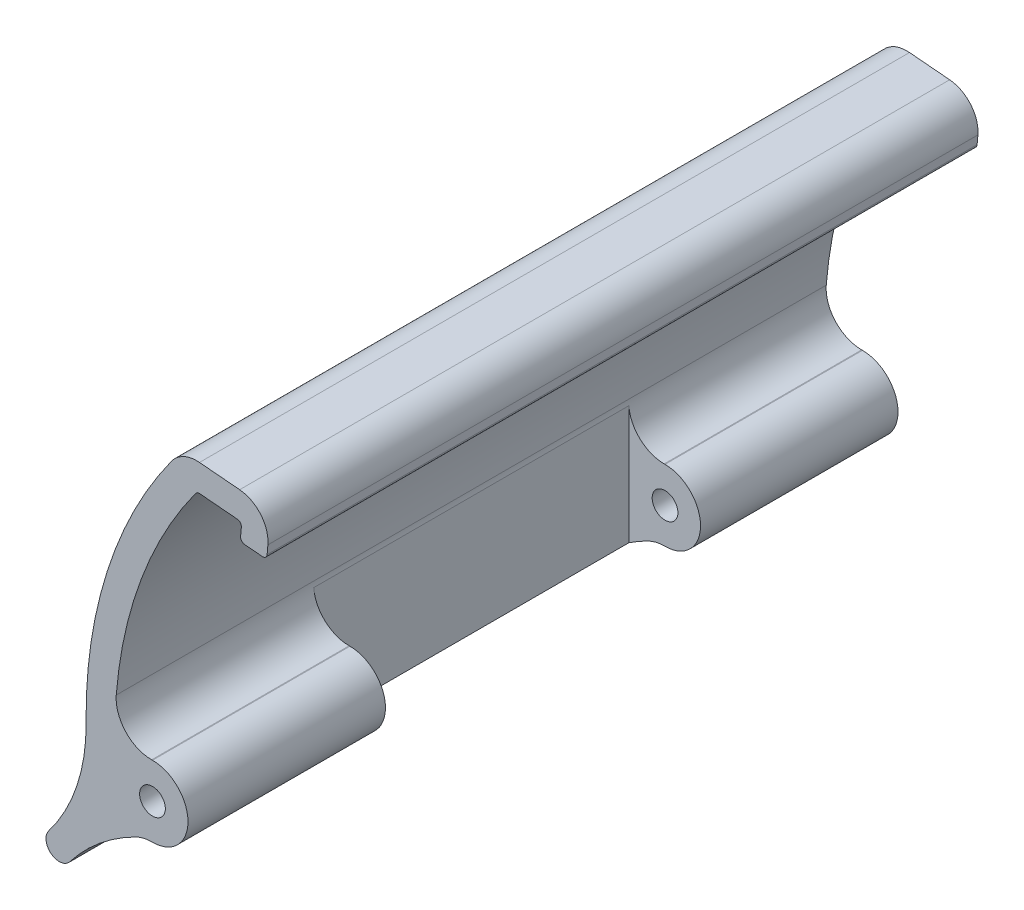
ISO-10303-21;
HEADER;
FILE_DESCRIPTION(('STEP AP214'),'2;1');
FILE_NAME('part.step','',(''),(''),'','','');
FILE_SCHEMA(('AUTOMOTIVE_DESIGN { 1 0 10303 214 1 1 1 1 }'));
ENDSEC;
DATA;
#1=APPLICATION_CONTEXT('core data for automotive mechanical design processes');
#2=APPLICATION_PROTOCOL_DEFINITION('international standard','automotive_design',2000,#1);
#3=PRODUCT_CONTEXT('',#1,'mechanical');
#4=PRODUCT('Part','Part','',(#3));
#5=PRODUCT_RELATED_PRODUCT_CATEGORY('part','',(#4));
#6=PRODUCT_DEFINITION_FORMATION('','',#4);
#7=PRODUCT_DEFINITION_CONTEXT('part definition',#1,'design');
#8=PRODUCT_DEFINITION('design','',#6,#7);
#9=PRODUCT_DEFINITION_SHAPE('','',#8);
#10=(LENGTH_UNIT() NAMED_UNIT(*) SI_UNIT(.MILLI.,.METRE.));
#11=(NAMED_UNIT(*) PLANE_ANGLE_UNIT() SI_UNIT($,.RADIAN.));
#12=(NAMED_UNIT(*) SI_UNIT($,.STERADIAN.) SOLID_ANGLE_UNIT());
#13=UNCERTAINTY_MEASURE_WITH_UNIT(LENGTH_MEASURE(1.E-05),#10,'distance_accuracy_value','');
#14=(GEOMETRIC_REPRESENTATION_CONTEXT(3) GLOBAL_UNCERTAINTY_ASSIGNED_CONTEXT((#13)) GLOBAL_UNIT_ASSIGNED_CONTEXT((#10,
#11,#12)) REPRESENTATION_CONTEXT('',''));
#15=CARTESIAN_POINT('',(0.,0.,0.));
#16=DIRECTION('',(0.,0.,1.));
#17=DIRECTION('',(1.,0.,0.));
#18=AXIS2_PLACEMENT_3D('',#15,#16,#17);
#19=CARTESIAN_POINT('',(-10.2594872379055,-3.29999999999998,40.));
#20=DIRECTION('',(0.,0.,-1.));
#21=DIRECTION('',(-1.,0.,0.));
#22=AXIS2_PLACEMENT_3D('',#19,#20,#21);
#23=CYLINDRICAL_SURFACE('',#22,4.);
#24=DIRECTION('',(0.,0.,1.));
#25=VECTOR('',#24,1.);
#26=CARTESIAN_POINT('',(-10.2594872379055,0.700000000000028,-46.7310757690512));
#27=LINE('',#26,#25);
#28=CARTESIAN_POINT('',(-10.2594872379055,0.700000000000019,-40.));
#29=VERTEX_POINT('',#28);
#30=CARTESIAN_POINT('',(-10.2594872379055,0.700000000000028,-17.75));
#31=VERTEX_POINT('',#30);
#32=EDGE_CURVE('E305',#29,#31,#27,.T.);
#33=ORIENTED_EDGE('',*,*,#32,.T.);
#34=CARTESIAN_POINT('',(-10.2594872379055,-3.29999999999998,-17.75));
#35=DIRECTION('',(0.,0.,1.));
#36=DIRECTION('',(1.,0.,0.));
#37=AXIS2_PLACEMENT_3D('',#34,#35,#36);
#38=CIRCLE('',#37,4.);
#39=CARTESIAN_POINT('',(-10.2594872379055,-7.29999999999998,-17.75));
#40=VERTEX_POINT('',#39);
#41=EDGE_CURVE('E295',#40,#31,#38,.T.);
#42=ORIENTED_EDGE('',*,*,#41,.F.);
#43=DIRECTION('',(0.,0.,1.));
#44=VECTOR('',#43,1.);
#45=CARTESIAN_POINT('',(-10.2594872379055,-7.29999999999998,-40.05));
#46=LINE('',#45,#44);
#47=CARTESIAN_POINT('',(-10.2594872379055,-7.29999999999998,-40.));
#48=VERTEX_POINT('',#47);
#49=EDGE_CURVE('E276',#48,#40,#46,.T.);
#50=ORIENTED_EDGE('',*,*,#49,.F.);
#51=CARTESIAN_POINT('',(-10.2594872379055,-3.29999999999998,-40.));
#52=DIRECTION('',(0.,0.,1.));
#53=DIRECTION('',(1.,0.,0.));
#54=AXIS2_PLACEMENT_3D('',#51,#52,#53);
#55=CIRCLE('',#54,4.);
#56=EDGE_CURVE('E331',#48,#29,#55,.T.);
#57=ORIENTED_EDGE('',*,*,#56,.T.);
#58=EDGE_LOOP('',(#33,#42,#50,#57));
#59=FACE_BOUND('',#58,.T.);
#60=ADVANCED_FACE('F45',(#59),#23,.T.);
#61=CARTESIAN_POINT('',(-10.2594872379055,-3.29999999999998,40.));
#62=DIRECTION('',(0.,0.,-1.));
#63=DIRECTION('',(-1.,0.,0.));
#64=AXIS2_PLACEMENT_3D('',#61,#62,#63);
#65=CYLINDRICAL_SURFACE('',#64,1.45);
#66=CARTESIAN_POINT('',(-10.2594872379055,-3.29999999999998,-40.));
#67=DIRECTION('',(0.,0.,1.));
#68=DIRECTION('',(1.,0.,0.));
#69=AXIS2_PLACEMENT_3D('',#66,#67,#68);
#70=CIRCLE('',#69,1.45);
#71=CARTESIAN_POINT('',(-8.8094872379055,-3.29999999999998,-40.));
#72=VERTEX_POINT('',#71);
#73=EDGE_CURVE('E332',#72,#72,#70,.T.);
#74=ORIENTED_EDGE('',*,*,#73,.F.);
#75=EDGE_LOOP('',(#74));
#76=FACE_BOUND('',#75,.T.);
#77=CARTESIAN_POINT('',(-10.2594872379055,-3.29999999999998,-17.75));
#78=DIRECTION('',(0.,0.,1.));
#79=DIRECTION('',(1.,0.,0.));
#80=AXIS2_PLACEMENT_3D('',#77,#78,#79);
#81=CIRCLE('',#80,1.45);
#82=CARTESIAN_POINT('',(-8.8094872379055,-3.29999999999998,-17.75));
#83=VERTEX_POINT('',#82);
#84=EDGE_CURVE('E297',#83,#83,#81,.T.);
#85=ORIENTED_EDGE('',*,*,#84,.T.);
#86=EDGE_LOOP('',(#85));
#87=FACE_BOUND('',#86,.T.);
#88=ADVANCED_FACE('F504',(#76,#87),#65,.F.);
#89=CARTESIAN_POINT('',(-14.4918878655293,0.700000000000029,-46.7310757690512));
#90=DIRECTION('',(0.,-1.,0.));
#91=DIRECTION('',(1.,0.,0.));
#92=AXIS2_PLACEMENT_3D('',#89,#90,#91);
#93=PLANE('',#92);
#94=DIRECTION('',(-1.,0.,0.));
#95=VECTOR('',#94,1.);
#96=CARTESIAN_POINT('',(-14.4918878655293,0.700000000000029,-17.75));
#97=LINE('',#96,#95);
#98=CARTESIAN_POINT('',(-10.3550938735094,0.700000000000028,-17.75));
#99=VERTEX_POINT('',#98);
#100=EDGE_CURVE('E293',#31,#99,#97,.T.);
#101=ORIENTED_EDGE('',*,*,#100,.F.);
#102=ORIENTED_EDGE('',*,*,#32,.F.);
#103=DIRECTION('',(-1.,0.,0.));
#104=VECTOR('',#103,1.);
#105=CARTESIAN_POINT('',(-14.4918878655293,0.700000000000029,-40.));
#106=LINE('',#105,#104);
#107=CARTESIAN_POINT('',(-10.3550938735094,0.700000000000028,-40.));
#108=VERTEX_POINT('',#107);
#109=EDGE_CURVE('E301',#29,#108,#106,.T.);
#110=ORIENTED_EDGE('',*,*,#109,.T.);
#111=DIRECTION('',(0.,0.,-1.));
#112=VECTOR('',#111,1.);
#113=CARTESIAN_POINT('',(-10.3550938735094,0.700000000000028,40.));
#114=LINE('',#113,#112);
#115=EDGE_CURVE('E413',#108,#99,#114,.F.);
#116=ORIENTED_EDGE('',*,*,#115,.T.);
#117=EDGE_LOOP('',(#101,#102,#110,#116));
#118=FACE_BOUND('',#117,.T.);
#119=ADVANCED_FACE('F509',(#118),#93,.F.);
#120=CARTESIAN_POINT('',(-10.3550938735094,4.70000000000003,-79.5));
#121=DIRECTION('',(0.,0.,1.));
#122=DIRECTION('',(1.,0.,0.));
#123=AXIS2_PLACEMENT_3D('',#120,#121,#122);
#124=CYLINDRICAL_SURFACE('',#123,4.);
#125=CARTESIAN_POINT('',(-10.3550938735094,4.70000000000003,-17.75));
#126=DIRECTION('',(0.,0.,1.));
#127=DIRECTION('',(1.,0.,0.));
#128=AXIS2_PLACEMENT_3D('',#125,#126,#127);
#129=CIRCLE('',#128,4.);
#130=CARTESIAN_POINT('',(-14.3422557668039,4.37978126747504,-17.75));
#131=VERTEX_POINT('',#130);
#132=EDGE_CURVE('E430',#99,#131,#129,.F.);
#133=ORIENTED_EDGE('',*,*,#132,.F.);
#134=ORIENTED_EDGE('',*,*,#115,.F.);
#135=CARTESIAN_POINT('',(-10.3550938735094,4.70000000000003,-40.));
#136=DIRECTION('',(0.,0.,1.));
#137=DIRECTION('',(1.,0.,0.));
#138=AXIS2_PLACEMENT_3D('',#135,#136,#137);
#139=CIRCLE('',#138,4.);
#140=CARTESIAN_POINT('',(-14.3422557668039,5.02021873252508,-40.));
#141=VERTEX_POINT('',#140);
#142=EDGE_CURVE('E421',#141,#108,#139,.T.);
#143=ORIENTED_EDGE('',*,*,#142,.F.);
#144=DIRECTION('',(0.,0.,1.));
#145=VECTOR('',#144,1.);
#146=CARTESIAN_POINT('',(-14.3422557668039,5.02021873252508,-79.5));
#147=LINE('',#146,#145);
#148=CARTESIAN_POINT('',(-14.3422557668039,5.02021873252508,40.));
#149=VERTEX_POINT('',#148);
#150=EDGE_CURVE('E420',#149,#141,#147,.F.);
#151=ORIENTED_EDGE('',*,*,#150,.F.);
#152=CARTESIAN_POINT('',(-10.3550938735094,4.70000000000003,40.));
#153=DIRECTION('',(0.,0.,1.));
#154=DIRECTION('',(1.,0.,0.));
#155=AXIS2_PLACEMENT_3D('',#152,#153,#154);
#156=CIRCLE('',#155,4.);
#157=CARTESIAN_POINT('',(-10.3550938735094,0.700000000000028,40.));
#158=VERTEX_POINT('',#157);
#159=EDGE_CURVE('E405',#158,#149,#156,.F.);
#160=ORIENTED_EDGE('',*,*,#159,.F.);
#161=CARTESIAN_POINT('',(-10.3550938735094,0.700000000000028,17.75));
#162=VERTEX_POINT('',#161);
#163=EDGE_CURVE('E410',#162,#158,#114,.F.);
#164=ORIENTED_EDGE('',*,*,#163,.F.);
#165=CARTESIAN_POINT('',(-10.3550938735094,4.70000000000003,17.75));
#166=DIRECTION('',(0.,0.,1.));
#167=DIRECTION('',(1.,0.,0.));
#168=AXIS2_PLACEMENT_3D('',#165,#166,#167);
#169=CIRCLE('',#168,4.);
#170=CARTESIAN_POINT('',(-14.3422557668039,4.37978126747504,17.75));
#171=VERTEX_POINT('',#170);
#172=EDGE_CURVE('E423',#162,#171,#169,.F.);
#173=ORIENTED_EDGE('',*,*,#172,.T.);
#174=DIRECTION('',(0.,0.,1.));
#175=VECTOR('',#174,1.);
#176=CARTESIAN_POINT('',(-14.3422557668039,4.37978126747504,-79.5));
#177=LINE('',#176,#175);
#178=EDGE_CURVE('E428',#171,#131,#177,.F.);
#179=ORIENTED_EDGE('',*,*,#178,.T.);
#180=EDGE_LOOP('',(#133,#134,#143,#151,#160,#164,#173,#179));
#181=FACE_BOUND('',#180,.T.);
#182=ADVANCED_FACE('F417',(#181),#124,.F.);
#183=CARTESIAN_POINT('',(33.0052917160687,1.21762128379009,-79.5));
#184=DIRECTION('',(0.,0.,1.));
#185=DIRECTION('',(1.,0.,0.));
#186=AXIS2_PLACEMENT_3D('',#183,#184,#185);
#187=CYLINDRICAL_SURFACE('',#186,47.5);
#188=CARTESIAN_POINT('',(33.0052917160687,1.21762128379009,-40.));
#189=DIRECTION('',(0.,0.,1.));
#190=DIRECTION('',(1.,0.,0.));
#191=AXIS2_PLACEMENT_3D('',#188,#189,#190);
#192=CIRCLE('',#191,47.5);
#193=CARTESIAN_POINT('',(-5.39567474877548,29.1750134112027,-40.));
#194=VERTEX_POINT('',#193);
#195=EDGE_CURVE('E342',#194,#141,#192,.T.);
#196=ORIENTED_EDGE('',*,*,#195,.F.);
#197=DIRECTION('',(0.,0.,1.));
#198=VECTOR('',#197,1.);
#199=CARTESIAN_POINT('',(-5.39567474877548,29.1750134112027,-79.5));
#200=LINE('',#199,#198);
#201=CARTESIAN_POINT('',(-5.39567474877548,29.1750134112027,40.));
#202=VERTEX_POINT('',#201);
#203=EDGE_CURVE('E432',#194,#202,#200,.T.);
#204=ORIENTED_EDGE('',*,*,#203,.T.);
#205=CARTESIAN_POINT('',(33.0052917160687,1.21762128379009,40.));
#206=DIRECTION('',(0.,0.,1.));
#207=DIRECTION('',(1.,0.,0.));
#208=AXIS2_PLACEMENT_3D('',#205,#206,#207);
#209=CIRCLE('',#208,47.5);
#210=EDGE_CURVE('E338',#202,#149,#209,.T.);
#211=ORIENTED_EDGE('',*,*,#210,.T.);
#212=ORIENTED_EDGE('',*,*,#150,.T.);
#213=EDGE_LOOP('',(#196,#204,#211,#212));
#214=FACE_BOUND('',#213,.T.);
#215=ADVANCED_FACE('F499',(#214),#187,.F.);
#216=CARTESIAN_POINT('',(-10.2594872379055,0.700000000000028,17.75));
#217=VERTEX_POINT('',#216);
#218=CARTESIAN_POINT('',(-10.2594872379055,0.700000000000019,40.));
#219=VERTEX_POINT('',#218);
#220=EDGE_CURVE('E308',#217,#219,#27,.T.);
#221=ORIENTED_EDGE('',*,*,#220,.T.);
#222=CARTESIAN_POINT('',(-10.2594872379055,-3.29999999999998,40.));
#223=DIRECTION('',(0.,0.,1.));
#224=DIRECTION('',(1.,0.,0.));
#225=AXIS2_PLACEMENT_3D('',#222,#223,#224);
#226=CIRCLE('',#225,4.);
#227=CARTESIAN_POINT('',(-10.2594872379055,-7.29999999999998,40.));
#228=VERTEX_POINT('',#227);
#229=EDGE_CURVE('E336',#228,#219,#226,.T.);
#230=ORIENTED_EDGE('',*,*,#229,.F.);
#231=CARTESIAN_POINT('',(-10.2594872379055,-7.29999999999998,17.75));
#232=VERTEX_POINT('',#231);
#233=EDGE_CURVE('E273',#232,#228,#46,.T.);
#234=ORIENTED_EDGE('',*,*,#233,.F.);
#235=CARTESIAN_POINT('',(-10.2594872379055,-3.29999999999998,17.75));
#236=DIRECTION('',(0.,0.,1.));
#237=DIRECTION('',(1.,0.,0.));
#238=AXIS2_PLACEMENT_3D('',#235,#236,#237);
#239=CIRCLE('',#238,4.);
#240=EDGE_CURVE('E288',#232,#217,#239,.T.);
#241=ORIENTED_EDGE('',*,*,#240,.T.);
#242=EDGE_LOOP('',(#221,#230,#234,#241));
#243=FACE_BOUND('',#242,.T.);
#244=ADVANCED_FACE('F398',(#243),#23,.T.);
#245=CARTESIAN_POINT('',(33.0052917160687,1.21762128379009,40.));
#246=DIRECTION('',(0.,0.,-1.));
#247=DIRECTION('',(-1.,0.,0.));
#248=AXIS2_PLACEMENT_3D('',#245,#246,#247);
#249=CYLINDRICAL_SURFACE('',#248,50.75);
#250=CARTESIAN_POINT('',(33.0052917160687,1.21762128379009,-40.));
#251=DIRECTION('',(0.,0.,1.));
#252=DIRECTION('',(1.,0.,0.));
#253=AXIS2_PLACEMENT_3D('',#250,#251,#252);
#254=CIRCLE('',#253,50.75);
#255=CARTESIAN_POINT('',(-8.10506982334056,30.9749846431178,-40.));
#256=VERTEX_POINT('',#255);
#257=CARTESIAN_POINT('',(-17.7409726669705,0.601868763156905,-40.));
#258=VERTEX_POINT('',#257);
#259=EDGE_CURVE('E341',#256,#258,#254,.T.);
#260=ORIENTED_EDGE('',*,*,#259,.T.);
#261=DIRECTION('',(0.,0.,1.));
#262=VECTOR('',#261,1.);
#263=CARTESIAN_POINT('',(-17.7409726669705,0.601868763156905,-58.1332455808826));
#264=LINE('',#263,#262);
#265=CARTESIAN_POINT('',(-17.7409726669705,0.601868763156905,40.));
#266=VERTEX_POINT('',#265);
#267=EDGE_CURVE('E241',#258,#266,#264,.T.);
#268=ORIENTED_EDGE('',*,*,#267,.T.);
#269=CARTESIAN_POINT('',(33.0052917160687,1.21762128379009,40.));
#270=DIRECTION('',(0.,0.,1.));
#271=DIRECTION('',(1.,0.,0.));
#272=AXIS2_PLACEMENT_3D('',#269,#270,#271);
#273=CIRCLE('',#272,50.75);
#274=CARTESIAN_POINT('',(-8.10506982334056,30.9749846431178,40.));
#275=VERTEX_POINT('',#274);
#276=EDGE_CURVE('E255',#275,#266,#273,.T.);
#277=ORIENTED_EDGE('',*,*,#276,.F.);
#278=DIRECTION('',(0.,0.,-1.));
#279=VECTOR('',#278,1.);
#280=CARTESIAN_POINT('',(-8.10506982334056,30.9749846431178,40.));
#281=LINE('',#280,#279);
#282=EDGE_CURVE('E450',#275,#256,#281,.T.);
#283=ORIENTED_EDGE('',*,*,#282,.T.);
#284=EDGE_LOOP('',(#260,#268,#277,#283));
#285=FACE_BOUND('',#284,.T.);
#286=ADVANCED_FACE('F491',(#285),#249,.T.);
#287=CARTESIAN_POINT('',(33.0052917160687,1.21762128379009,40.));
#288=DIRECTION('',(0.,0.,1.));
#289=DIRECTION('',(1.,0.,0.));
#290=AXIS2_PLACEMENT_3D('',#287,#288,#289);
#291=PLANE('',#290);
#292=ORIENTED_EDGE('',*,*,#276,.T.);
#293=CARTESIAN_POINT('',(-38.045917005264,0.3554896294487,40.));
#294=DIRECTION('',(0.,0.,1.));
#295=DIRECTION('',(1.,0.,0.));
#296=AXIS2_PLACEMENT_3D('',#293,#294,#295);
#297=CIRCLE('',#296,20.3064390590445);
#298=CARTESIAN_POINT('',(-21.9485692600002,-12.0229942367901,40.));
#299=VERTEX_POINT('',#298);
#300=EDGE_CURVE('E235',#266,#299,#297,.F.);
#301=ORIENTED_EDGE('',*,*,#300,.T.);
#302=CARTESIAN_POINT('',(-20.7594872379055,-12.937370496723,40.));
#303=DIRECTION('',(0.,0.,1.));
#304=DIRECTION('',(1.,0.,0.));
#305=AXIS2_PLACEMENT_3D('',#302,#303,#304);
#306=CIRCLE('',#305,1.50000000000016);
#307=CARTESIAN_POINT('',(-19.5704052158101,-13.8517467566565,40.));
#308=VERTEX_POINT('',#307);
#309=EDGE_CURVE('E245',#299,#308,#306,.T.);
#310=ORIENTED_EDGE('',*,*,#309,.T.);
#311=CARTESIAN_POINT('',(-2.52762855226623,-26.9572433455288,40.));
#312=DIRECTION('',(0.,0.,1.));
#313=DIRECTION('',(1.,0.,0.));
#314=AXIS2_PLACEMENT_3D('',#311,#312,#313);
#315=CIRCLE('',#314,21.4990761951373);
#316=CARTESIAN_POINT('',(-12.1285505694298,-7.72101259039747,40.));
#317=VERTEX_POINT('',#316);
#318=EDGE_CURVE('E268',#317,#308,#315,.T.);
#319=ORIENTED_EDGE('',*,*,#318,.F.);
#320=CARTESIAN_POINT('',(-10.3422557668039,-11.3,40.));
#321=DIRECTION('',(0.,0.,1.));
#322=DIRECTION('',(1.,0.,0.));
#323=AXIS2_PLACEMENT_3D('',#320,#321,#322);
#324=CIRCLE('',#323,4.);
#325=CARTESIAN_POINT('',(-10.3422557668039,-7.29999999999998,40.));
#326=VERTEX_POINT('',#325);
#327=EDGE_CURVE('E371',#317,#326,#324,.F.);
#328=ORIENTED_EDGE('',*,*,#327,.T.);
#329=DIRECTION('',(-1.,0.,0.));
#330=VECTOR('',#329,1.);
#331=CARTESIAN_POINT('',(-10.2594872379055,-7.29999999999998,40.));
#332=LINE('',#331,#330);
#333=EDGE_CURVE('E270',#228,#326,#332,.T.);
#334=ORIENTED_EDGE('',*,*,#333,.F.);
#335=ORIENTED_EDGE('',*,*,#229,.T.);
#336=DIRECTION('',(1.,0.,0.));
#337=VECTOR('',#336,1.);
#338=CARTESIAN_POINT('',(-14.4918878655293,0.700000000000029,40.));
#339=LINE('',#338,#337);
#340=EDGE_CURVE('E300',#158,#219,#339,.T.);
#341=ORIENTED_EDGE('',*,*,#340,.F.);
#342=ORIENTED_EDGE('',*,*,#159,.T.);
#343=ORIENTED_EDGE('',*,*,#210,.F.);
#344=CARTESIAN_POINT('',(-4.99145404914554,28.8807250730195,40.));
#345=DIRECTION('',(0.,0.,1.));
#346=DIRECTION('',(1.,0.,0.));
#347=AXIS2_PLACEMENT_3D('',#344,#345,#346);
#348=CIRCLE('',#347,0.5);
#349=CARTESIAN_POINT('',(-4.94787617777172,29.3788224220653,40.));
#350=VERTEX_POINT('',#349);
#351=EDGE_CURVE('E442',#202,#350,#348,.F.);
#352=ORIENTED_EDGE('',*,*,#351,.T.);
#353=DIRECTION('',(-0.996194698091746,0.0871557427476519,0.));
#354=VECTOR('',#353,1.);
#355=CARTESIAN_POINT('',(-4.83647437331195,29.3690760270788,40.));
#356=LINE('',#355,#354);
#357=CARTESIAN_POINT('',(-0.700918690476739,29.0072617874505,40.));
#358=VERTEX_POINT('',#357);
#359=EDGE_CURVE('E335',#358,#350,#356,.T.);
#360=ORIENTED_EDGE('',*,*,#359,.F.);
#361=CARTESIAN_POINT('',(-0.744496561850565,28.5091644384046,40.));
#362=DIRECTION('',(0.,0.,1.));
#363=DIRECTION('',(1.,0.,0.));
#364=AXIS2_PLACEMENT_3D('',#361,#362,#363);
#365=CIRCLE('',#364,0.5);
#366=CARTESIAN_POINT('',(-0.246399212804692,28.4655865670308,40.));
#367=VERTEX_POINT('',#366);
#368=EDGE_CURVE('E448',#358,#367,#365,.F.);
#369=ORIENTED_EDGE('',*,*,#368,.T.);
#370=DIRECTION('',(0.087155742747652,0.996194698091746,0.));
#371=VECTOR('',#370,1.);
#372=CARTESIAN_POINT('',(-0.375598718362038,26.9888294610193,40.));
#373=LINE('',#372,#371);
#374=CARTESIAN_POINT('',(-0.332020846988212,27.4869268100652,40.));
#375=VERTEX_POINT('',#374);
#376=EDGE_CURVE('E304',#375,#367,#373,.T.);
#377=ORIENTED_EDGE('',*,*,#376,.F.);
#378=CARTESIAN_POINT('',(0.166076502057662,27.4433489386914,40.));
#379=DIRECTION('',(0.,0.,1.));
#380=DIRECTION('',(1.,0.,0.));
#381=AXIS2_PLACEMENT_3D('',#378,#379,#380);
#382=CIRCLE('',#381,0.5);
#383=CARTESIAN_POINT('',(0.122498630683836,26.9452515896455,40.));
#384=VERTEX_POINT('',#383);
#385=EDGE_CURVE('E804',#375,#384,#382,.T.);
#386=ORIENTED_EDGE('',*,*,#385,.T.);
#387=DIRECTION('',(0.996194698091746,-0.087155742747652,0.));
#388=VECTOR('',#387,1.);
#389=CARTESIAN_POINT('',(-0.375598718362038,26.9888294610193,40.));
#390=LINE('',#389,#388);
#391=CARTESIAN_POINT('',(2.11488802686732,26.7709401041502,40.));
#392=VERTEX_POINT('',#391);
#393=EDGE_CURVE('E317',#384,#392,#390,.T.);
#394=ORIENTED_EDGE('',*,*,#393,.T.);
#395=CARTESIAN_POINT('',(2.15846589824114,27.2690374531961,40.));
#396=DIRECTION('',(0.,0.,1.));
#397=DIRECTION('',(1.,0.,0.));
#398=AXIS2_PLACEMENT_3D('',#395,#396,#397);
#399=CIRCLE('',#398,0.5);
#400=CARTESIAN_POINT('',(2.65656324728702,27.2254595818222,40.));
#401=VERTEX_POINT('',#400);
#402=EDGE_CURVE('E475',#392,#401,#399,.T.);
#403=ORIENTED_EDGE('',*,*,#402,.T.);
#404=DIRECTION('',(0.0871557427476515,0.996194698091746,0.));
#405=VECTOR('',#404,1.);
#406=CARTESIAN_POINT('',(2.8409614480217,29.333140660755,40.));
#407=LINE('',#406,#405);
#408=CARTESIAN_POINT('',(2.74371899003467,28.221654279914,40.));
#409=VERTEX_POINT('',#408);
#410=EDGE_CURVE('E327',#401,#409,#407,.T.);
#411=ORIENTED_EDGE('',*,*,#410,.T.);
#412=CARTESIAN_POINT('',(-0.742962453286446,28.5266993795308,40.));
#413=DIRECTION('',(0.,0.,1.));
#414=DIRECTION('',(1.,0.,0.));
#415=AXIS2_PLACEMENT_3D('',#412,#413,#414);
#416=CIRCLE('',#415,3.5);
#417=CARTESIAN_POINT('',(-0.437917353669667,32.0133808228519,40.));
#418=VERTEX_POINT('',#417);
#419=EDGE_CURVE('E462',#409,#418,#416,.T.);
#420=ORIENTED_EDGE('',*,*,#419,.T.);
#421=DIRECTION('',(-0.996194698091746,0.087155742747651,0.));
#422=VECTOR('',#421,1.);
#423=CARTESIAN_POINT('',(-6.,32.5,40.));
#424=LINE('',#423,#422);
#425=CARTESIAN_POINT('',(-4.96482737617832,32.4094341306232,40.));
#426=VERTEX_POINT('',#425);
#427=EDGE_CURVE('E320',#418,#426,#424,.T.);
#428=ORIENTED_EDGE('',*,*,#427,.T.);
#429=CARTESIAN_POINT('',(-5.2698724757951,28.9227526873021,40.));
#430=DIRECTION('',(0.,0.,1.));
#431=DIRECTION('',(1.,0.,0.));
#432=AXIS2_PLACEMENT_3D('',#429,#430,#431);
#433=CIRCLE('',#432,3.5);
#434=EDGE_CURVE('E464',#426,#275,#433,.T.);
#435=ORIENTED_EDGE('',*,*,#434,.T.);
#436=EDGE_LOOP('',(#292,#301,#310,#319,#328,#334,#335,#341,#342,#343,#352,#360,#369,#377,#386,
#394,#403,#411,#420,#428,#435));
#437=FACE_BOUND('',#436,.T.);
#438=CARTESIAN_POINT('',(-10.2594872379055,-3.29999999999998,40.));
#439=DIRECTION('',(0.,0.,1.));
#440=DIRECTION('',(1.,0.,0.));
#441=AXIS2_PLACEMENT_3D('',#438,#439,#440);
#442=CIRCLE('',#441,1.45);
#443=CARTESIAN_POINT('',(-8.8094872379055,-3.29999999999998,40.));
#444=VERTEX_POINT('',#443);
#445=EDGE_CURVE('E328',#444,#444,#442,.T.);
#446=ORIENTED_EDGE('',*,*,#445,.F.);
#447=EDGE_LOOP('',(#446));
#448=FACE_BOUND('',#447,.T.);
#449=ADVANCED_FACE('F252',(#437,#448),#291,.T.);
#450=CARTESIAN_POINT('',(33.0052917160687,1.21762128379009,-40.));
#451=DIRECTION('',(0.,0.,1.));
#452=DIRECTION('',(1.,0.,0.));
#453=AXIS2_PLACEMENT_3D('',#450,#451,#452);
#454=PLANE('',#453);
#455=CARTESIAN_POINT('',(-2.52762855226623,-26.9572433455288,-40.));
#456=DIRECTION('',(0.,0.,1.));
#457=DIRECTION('',(1.,0.,0.));
#458=AXIS2_PLACEMENT_3D('',#455,#456,#457);
#459=CIRCLE('',#458,21.4990761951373);
#460=CARTESIAN_POINT('',(-12.1285505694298,-7.72101259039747,-40.));
#461=VERTEX_POINT('',#460);
#462=CARTESIAN_POINT('',(-19.5704052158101,-13.8517467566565,-40.));
#463=VERTEX_POINT('',#462);
#464=EDGE_CURVE('E266',#461,#463,#459,.T.);
#465=ORIENTED_EDGE('',*,*,#464,.T.);
#466=CARTESIAN_POINT('',(-20.7594872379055,-12.937370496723,-40.));
#467=DIRECTION('',(0.,0.,1.));
#468=DIRECTION('',(1.,0.,0.));
#469=AXIS2_PLACEMENT_3D('',#466,#467,#468);
#470=CIRCLE('',#469,1.50000000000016);
#471=CARTESIAN_POINT('',(-21.9485692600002,-12.0229942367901,-40.));
#472=VERTEX_POINT('',#471);
#473=EDGE_CURVE('E260',#463,#472,#470,.F.);
#474=ORIENTED_EDGE('',*,*,#473,.T.);
#475=CARTESIAN_POINT('',(-38.045917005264,0.3554896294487,-40.));
#476=DIRECTION('',(0.,0.,1.));
#477=DIRECTION('',(1.,0.,0.));
#478=AXIS2_PLACEMENT_3D('',#475,#476,#477);
#479=CIRCLE('',#478,20.3064390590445);
#480=EDGE_CURVE('E237',#472,#258,#479,.T.);
#481=ORIENTED_EDGE('',*,*,#480,.T.);
#482=ORIENTED_EDGE('',*,*,#259,.F.);
#483=CARTESIAN_POINT('',(-5.2698724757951,28.9227526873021,-40.));
#484=DIRECTION('',(0.,0.,1.));
#485=DIRECTION('',(1.,0.,0.));
#486=AXIS2_PLACEMENT_3D('',#483,#484,#485);
#487=CIRCLE('',#486,3.5);
#488=CARTESIAN_POINT('',(-4.96482737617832,32.4094341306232,-40.));
#489=VERTEX_POINT('',#488);
#490=EDGE_CURVE('E455',#256,#489,#487,.F.);
#491=ORIENTED_EDGE('',*,*,#490,.T.);
#492=DIRECTION('',(-0.996194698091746,0.087155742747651,0.));
#493=VECTOR('',#492,1.);
#494=CARTESIAN_POINT('',(-6.,32.5,-40.));
#495=LINE('',#494,#493);
#496=CARTESIAN_POINT('',(-0.437917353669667,32.0133808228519,-40.));
#497=VERTEX_POINT('',#496);
#498=EDGE_CURVE('E324',#497,#489,#495,.T.);
#499=ORIENTED_EDGE('',*,*,#498,.F.);
#500=CARTESIAN_POINT('',(-0.742962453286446,28.5266993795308,-40.));
#501=DIRECTION('',(0.,0.,1.));
#502=DIRECTION('',(1.,0.,0.));
#503=AXIS2_PLACEMENT_3D('',#500,#501,#502);
#504=CIRCLE('',#503,3.5);
#505=CARTESIAN_POINT('',(2.74371899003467,28.221654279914,-40.));
#506=VERTEX_POINT('',#505);
#507=EDGE_CURVE('E453',#497,#506,#504,.F.);
#508=ORIENTED_EDGE('',*,*,#507,.T.);
#509=DIRECTION('',(0.0871557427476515,0.996194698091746,0.));
#510=VECTOR('',#509,1.);
#511=CARTESIAN_POINT('',(2.8409614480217,29.333140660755,-40.));
#512=LINE('',#511,#510);
#513=CARTESIAN_POINT('',(2.65656324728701,27.2254595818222,-40.));
#514=VERTEX_POINT('',#513);
#515=EDGE_CURVE('E319',#514,#506,#512,.T.);
#516=ORIENTED_EDGE('',*,*,#515,.F.);
#517=CARTESIAN_POINT('',(2.15846589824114,27.2690374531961,-40.));
#518=DIRECTION('',(0.,0.,1.));
#519=DIRECTION('',(1.,0.,0.));
#520=AXIS2_PLACEMENT_3D('',#517,#518,#519);
#521=CIRCLE('',#520,0.5);
#522=CARTESIAN_POINT('',(2.11488802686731,26.7709401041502,-40.));
#523=VERTEX_POINT('',#522);
#524=EDGE_CURVE('E809',#514,#523,#521,.F.);
#525=ORIENTED_EDGE('',*,*,#524,.T.);
#526=DIRECTION('',(0.996194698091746,-0.087155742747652,0.));
#527=VECTOR('',#526,1.);
#528=CARTESIAN_POINT('',(-0.375598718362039,26.9888294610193,-40.));
#529=LINE('',#528,#527);
#530=CARTESIAN_POINT('',(0.122498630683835,26.9452515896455,-40.));
#531=VERTEX_POINT('',#530);
#532=EDGE_CURVE('E315',#531,#523,#529,.T.);
#533=ORIENTED_EDGE('',*,*,#532,.F.);
#534=CARTESIAN_POINT('',(0.166076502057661,27.4433489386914,-40.));
#535=DIRECTION('',(0.,0.,1.));
#536=DIRECTION('',(1.,0.,0.));
#537=AXIS2_PLACEMENT_3D('',#534,#535,#536);
#538=CIRCLE('',#537,0.5);
#539=CARTESIAN_POINT('',(-0.332020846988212,27.4869268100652,-40.));
#540=VERTEX_POINT('',#539);
#541=EDGE_CURVE('E414',#531,#540,#538,.F.);
#542=ORIENTED_EDGE('',*,*,#541,.T.);
#543=DIRECTION('',(-0.087155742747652,-0.996194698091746,0.));
#544=VECTOR('',#543,1.);
#545=CARTESIAN_POINT('',(0.0601799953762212,31.969802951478,-40.));
#546=LINE('',#545,#544);
#547=CARTESIAN_POINT('',(-0.246399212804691,28.4655865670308,-40.));
#548=VERTEX_POINT('',#547);
#549=EDGE_CURVE('E313',#548,#540,#546,.T.);
#550=ORIENTED_EDGE('',*,*,#549,.F.);
#551=CARTESIAN_POINT('',(-0.744496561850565,28.5091644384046,-40.));
#552=DIRECTION('',(0.,0.,1.));
#553=DIRECTION('',(1.,0.,0.));
#554=AXIS2_PLACEMENT_3D('',#551,#552,#553);
#555=CIRCLE('',#554,0.5);
#556=CARTESIAN_POINT('',(-0.700918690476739,29.0072617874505,-40.));
#557=VERTEX_POINT('',#556);
#558=EDGE_CURVE('E446',#548,#557,#555,.T.);
#559=ORIENTED_EDGE('',*,*,#558,.T.);
#560=DIRECTION('',(-0.996194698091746,0.0871557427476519,0.));
#561=VECTOR('',#560,1.);
#562=CARTESIAN_POINT('',(-4.83647437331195,29.3690760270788,-40.));
#563=LINE('',#562,#561);
#564=CARTESIAN_POINT('',(-4.94787617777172,29.3788224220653,-40.));
#565=VERTEX_POINT('',#564);
#566=EDGE_CURVE('E323',#557,#565,#563,.T.);
#567=ORIENTED_EDGE('',*,*,#566,.T.);
#568=CARTESIAN_POINT('',(-4.99145404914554,28.8807250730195,-40.));
#569=DIRECTION('',(0.,0.,1.));
#570=DIRECTION('',(1.,0.,0.));
#571=AXIS2_PLACEMENT_3D('',#568,#569,#570);
#572=CIRCLE('',#571,0.5);
#573=EDGE_CURVE('E444',#565,#194,#572,.T.);
#574=ORIENTED_EDGE('',*,*,#573,.T.);
#575=ORIENTED_EDGE('',*,*,#195,.T.);
#576=ORIENTED_EDGE('',*,*,#142,.T.);
#577=ORIENTED_EDGE('',*,*,#109,.F.);
#578=ORIENTED_EDGE('',*,*,#56,.F.);
#579=DIRECTION('',(-1.,0.,0.));
#580=VECTOR('',#579,1.);
#581=CARTESIAN_POINT('',(33.0052917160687,-7.29999999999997,-40.));
#582=LINE('',#581,#580);
#583=CARTESIAN_POINT('',(-10.3422557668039,-7.29999999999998,-40.));
#584=VERTEX_POINT('',#583);
#585=EDGE_CURVE('E280',#48,#584,#582,.T.);
#586=ORIENTED_EDGE('',*,*,#585,.T.);
#587=CARTESIAN_POINT('',(-10.3422557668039,-11.3,-40.));
#588=DIRECTION('',(0.,0.,1.));
#589=DIRECTION('',(1.,0.,0.));
#590=AXIS2_PLACEMENT_3D('',#587,#588,#589);
#591=CIRCLE('',#590,4.);
#592=EDGE_CURVE('E368',#584,#461,#591,.T.);
#593=ORIENTED_EDGE('',*,*,#592,.T.);
#594=EDGE_LOOP('',(#465,#474,#481,#482,#491,#499,#508,#516,#525,#533,#542,#550,#559,#567,#574,
#575,#576,#577,#578,#586,#593));
#595=FACE_BOUND('',#594,.T.);
#596=ORIENTED_EDGE('',*,*,#73,.T.);
#597=EDGE_LOOP('',(#596));
#598=FACE_BOUND('',#597,.T.);
#599=ADVANCED_FACE('F483',(#595,#598),#454,.F.);
#600=CARTESIAN_POINT('',(-10.2594872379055,-3.29999999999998,17.75));
#601=DIRECTION('',(0.,0.,1.));
#602=DIRECTION('',(1.,0.,0.));
#603=AXIS2_PLACEMENT_3D('',#600,#601,#602);
#604=CIRCLE('',#603,1.45);
#605=CARTESIAN_POINT('',(-8.8094872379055,-3.29999999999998,17.75));
#606=VERTEX_POINT('',#605);
#607=EDGE_CURVE('E290',#606,#606,#604,.T.);
#608=ORIENTED_EDGE('',*,*,#607,.F.);
#609=EDGE_LOOP('',(#608));
#610=FACE_BOUND('',#609,.T.);
#611=ORIENTED_EDGE('',*,*,#445,.T.);
#612=EDGE_LOOP('',(#611));
#613=FACE_BOUND('',#612,.T.);
#614=ADVANCED_FACE('F512',(#610,#613),#65,.F.);
#615=CARTESIAN_POINT('',(-4.83647437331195,29.3690760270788,44.2195357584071));
#616=DIRECTION('',(-0.0871557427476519,-0.996194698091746,0.));
#617=DIRECTION('',(0.996194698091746,-0.0871557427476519,0.));
#618=AXIS2_PLACEMENT_3D('',#615,#616,#617);
#619=PLANE('',#618);
#620=ORIENTED_EDGE('',*,*,#359,.T.);
#621=DIRECTION('',(0.,0.,1.));
#622=VECTOR('',#621,1.);
#623=CARTESIAN_POINT('',(-4.94787617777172,29.3788224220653,44.2195357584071));
#624=LINE('',#623,#622);
#625=EDGE_CURVE('E437',#350,#565,#624,.F.);
#626=ORIENTED_EDGE('',*,*,#625,.T.);
#627=ORIENTED_EDGE('',*,*,#566,.F.);
#628=DIRECTION('',(0.,0.,-1.));
#629=VECTOR('',#628,1.);
#630=CARTESIAN_POINT('',(-0.700918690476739,29.0072617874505,40.));
#631=LINE('',#630,#629);
#632=EDGE_CURVE('E435',#557,#358,#631,.F.);
#633=ORIENTED_EDGE('',*,*,#632,.T.);
#634=EDGE_LOOP('',(#620,#626,#627,#633));
#635=FACE_BOUND('',#634,.T.);
#636=ADVANCED_FACE('F528',(#635),#619,.T.);
#637=CARTESIAN_POINT('',(-6.,32.5,40.));
#638=DIRECTION('',(-0.087155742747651,-0.996194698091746,0.));
#639=DIRECTION('',(0.996194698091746,-0.087155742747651,0.));
#640=AXIS2_PLACEMENT_3D('',#637,#638,#639);
#641=PLANE('',#640);
#642=ORIENTED_EDGE('',*,*,#498,.T.);
#643=DIRECTION('',(0.,0.,-1.));
#644=VECTOR('',#643,1.);
#645=CARTESIAN_POINT('',(-4.96482737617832,32.4094341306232,40.));
#646=LINE('',#645,#644);
#647=EDGE_CURVE('E460',#489,#426,#646,.F.);
#648=ORIENTED_EDGE('',*,*,#647,.T.);
#649=ORIENTED_EDGE('',*,*,#427,.F.);
#650=DIRECTION('',(0.,0.,-1.));
#651=VECTOR('',#650,1.);
#652=CARTESIAN_POINT('',(-0.437917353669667,32.0133808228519,40.));
#653=LINE('',#652,#651);
#654=EDGE_CURVE('E457',#418,#497,#653,.T.);
#655=ORIENTED_EDGE('',*,*,#654,.T.);
#656=EDGE_LOOP('',(#642,#648,#649,#655));
#657=FACE_BOUND('',#656,.T.);
#658=ADVANCED_FACE('F480',(#657),#641,.F.);
#659=CARTESIAN_POINT('',(2.8409614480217,29.333140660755,40.));
#660=DIRECTION('',(-0.996194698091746,0.0871557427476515,0.));
#661=DIRECTION('',(-0.0871557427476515,-0.996194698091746,0.));
#662=AXIS2_PLACEMENT_3D('',#659,#660,#661);
#663=PLANE('',#662);
#664=ORIENTED_EDGE('',*,*,#515,.T.);
#665=DIRECTION('',(0.,0.,-1.));
#666=VECTOR('',#665,1.);
#667=CARTESIAN_POINT('',(2.74371899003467,28.221654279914,40.));
#668=LINE('',#667,#666);
#669=EDGE_CURVE('E362',#506,#409,#668,.F.);
#670=ORIENTED_EDGE('',*,*,#669,.T.);
#671=ORIENTED_EDGE('',*,*,#410,.F.);
#672=DIRECTION('',(0.,0.,1.));
#673=VECTOR('',#672,1.);
#674=CARTESIAN_POINT('',(2.65656324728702,27.2254595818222,40.));
#675=LINE('',#674,#673);
#676=EDGE_CURVE('E812',#401,#514,#675,.F.);
#677=ORIENTED_EDGE('',*,*,#676,.T.);
#678=EDGE_LOOP('',(#664,#670,#671,#677));
#679=FACE_BOUND('',#678,.T.);
#680=ADVANCED_FACE('F468',(#679),#663,.F.);
#681=CARTESIAN_POINT('',(-0.375598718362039,26.9888294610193,-40.));
#682=DIRECTION('',(0.087155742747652,0.996194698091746,0.));
#683=DIRECTION('',(-0.996194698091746,0.087155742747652,0.));
#684=AXIS2_PLACEMENT_3D('',#681,#682,#683);
#685=PLANE('',#684);
#686=ORIENTED_EDGE('',*,*,#393,.F.);
#687=DIRECTION('',(0.,0.,1.));
#688=VECTOR('',#687,1.);
#689=CARTESIAN_POINT('',(0.122498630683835,26.9452515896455,-40.));
#690=LINE('',#689,#688);
#691=EDGE_CURVE('E802',#384,#531,#690,.F.);
#692=ORIENTED_EDGE('',*,*,#691,.T.);
#693=ORIENTED_EDGE('',*,*,#532,.T.);
#694=DIRECTION('',(0.,0.,1.));
#695=VECTOR('',#694,1.);
#696=CARTESIAN_POINT('',(2.11488802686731,26.7709401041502,-40.));
#697=LINE('',#696,#695);
#698=EDGE_CURVE('E344',#523,#392,#697,.T.);
#699=ORIENTED_EDGE('',*,*,#698,.T.);
#700=EDGE_LOOP('',(#686,#692,#693,#699));
#701=FACE_BOUND('',#700,.T.);
#702=ADVANCED_FACE('F520',(#701),#685,.F.);
#703=CARTESIAN_POINT('',(-2.71602615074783,0.237621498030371,0.));
#704=DIRECTION('',(-0.996194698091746,0.087155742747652,0.));
#705=DIRECTION('',(-0.087155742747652,-0.996194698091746,0.));
#706=AXIS2_PLACEMENT_3D('',#703,#704,#705);
#707=PLANE('',#706);
#708=ORIENTED_EDGE('',*,*,#376,.T.);
#709=DIRECTION('',(0.,0.,-1.));
#710=VECTOR('',#709,1.);
#711=CARTESIAN_POINT('',(-0.246399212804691,28.4655865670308,-40.));
#712=LINE('',#711,#710);
#713=EDGE_CURVE('E439',#367,#548,#712,.T.);
#714=ORIENTED_EDGE('',*,*,#713,.T.);
#715=ORIENTED_EDGE('',*,*,#549,.T.);
#716=DIRECTION('',(0.,0.,1.));
#717=VECTOR('',#716,1.);
#718=CARTESIAN_POINT('',(-0.332020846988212,27.4869268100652,40.));
#719=LINE('',#718,#717);
#720=EDGE_CURVE('E806',#540,#375,#719,.T.);
#721=ORIENTED_EDGE('',*,*,#720,.T.);
#722=EDGE_LOOP('',(#708,#714,#715,#721));
#723=FACE_BOUND('',#722,.T.);
#724=ADVANCED_FACE('F525',(#723),#707,.T.);
#725=ORIENTED_EDGE('',*,*,#220,.F.);
#726=DIRECTION('',(-1.,0.,0.));
#727=VECTOR('',#726,1.);
#728=CARTESIAN_POINT('',(-14.4918878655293,0.700000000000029,17.75));
#729=LINE('',#728,#727);
#730=EDGE_CURVE('E284',#217,#162,#729,.T.);
#731=ORIENTED_EDGE('',*,*,#730,.T.);
#732=ORIENTED_EDGE('',*,*,#163,.T.);
#733=ORIENTED_EDGE('',*,*,#340,.T.);
#734=EDGE_LOOP('',(#725,#731,#732,#733));
#735=FACE_BOUND('',#734,.T.);
#736=ADVANCED_FACE('F408',(#735),#93,.F.);
#737=CARTESIAN_POINT('',(2.15846589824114,27.2690374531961,-40.));
#738=DIRECTION('',(0.,0.,1.));
#739=DIRECTION('',(0.,-1.,0.));
#740=AXIS2_PLACEMENT_3D('',#737,#738,#739);
#741=CYLINDRICAL_SURFACE('',#740,0.5);
#742=ORIENTED_EDGE('',*,*,#524,.F.);
#743=ORIENTED_EDGE('',*,*,#676,.F.);
#744=ORIENTED_EDGE('',*,*,#402,.F.);
#745=ORIENTED_EDGE('',*,*,#698,.F.);
#746=EDGE_LOOP('',(#742,#743,#744,#745));
#747=FACE_BOUND('',#746,.T.);
#748=ADVANCED_FACE('F539',(#747),#741,.T.);
#749=CARTESIAN_POINT('',(0.166076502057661,27.4433489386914,0.));
#750=DIRECTION('',(0.,0.,-1.));
#751=DIRECTION('',(0.,1.,0.));
#752=AXIS2_PLACEMENT_3D('',#749,#750,#751);
#753=CYLINDRICAL_SURFACE('',#752,0.5);
#754=ORIENTED_EDGE('',*,*,#541,.F.);
#755=ORIENTED_EDGE('',*,*,#691,.F.);
#756=ORIENTED_EDGE('',*,*,#385,.F.);
#757=ORIENTED_EDGE('',*,*,#720,.F.);
#758=EDGE_LOOP('',(#754,#755,#756,#757));
#759=FACE_BOUND('',#758,.T.);
#760=ADVANCED_FACE('F543',(#759),#753,.T.);
#761=CARTESIAN_POINT('',(-14.3422557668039,5.02021873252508,-17.75));
#762=DIRECTION('',(-1.,0.,0.));
#763=DIRECTION('',(0.,-1.,0.));
#764=AXIS2_PLACEMENT_3D('',#761,#762,#763);
#765=PLANE('',#764);
#766=DIRECTION('',(0.,-1.,0.));
#767=VECTOR('',#766,1.);
#768=CARTESIAN_POINT('',(-14.3422557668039,5.02021873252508,17.75));
#769=LINE('',#768,#767);
#770=CARTESIAN_POINT('',(-14.3422557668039,-8.99548226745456,17.75));
#771=VERTEX_POINT('',#770);
#772=EDGE_CURVE('E67',#171,#771,#769,.T.);
#773=ORIENTED_EDGE('',*,*,#772,.T.);
#774=DIRECTION('',(0.,0.,1.));
#775=VECTOR('',#774,1.);
#776=CARTESIAN_POINT('',(-14.3422557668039,-8.99548226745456,-40.05));
#777=LINE('',#776,#775);
#778=CARTESIAN_POINT('',(-14.3422557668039,-8.99548226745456,-17.75));
#779=VERTEX_POINT('',#778);
#780=EDGE_CURVE('E53',#771,#779,#777,.F.);
#781=ORIENTED_EDGE('',*,*,#780,.T.);
#782=DIRECTION('',(0.,-1.,0.));
#783=VECTOR('',#782,1.);
#784=CARTESIAN_POINT('',(-14.3422557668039,5.02021873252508,-17.75));
#785=LINE('',#784,#783);
#786=EDGE_CURVE('E60',#131,#779,#785,.T.);
#787=ORIENTED_EDGE('',*,*,#786,.F.);
#788=ORIENTED_EDGE('',*,*,#178,.F.);
#789=EDGE_LOOP('',(#773,#781,#787,#788));
#790=FACE_BOUND('',#789,.T.);
#791=ADVANCED_FACE('F381',(#790),#765,.F.);
#792=CARTESIAN_POINT('',(0.,0.,-17.75));
#793=DIRECTION('',(0.,0.,1.));
#794=DIRECTION('',(1.,0.,0.));
#795=AXIS2_PLACEMENT_3D('',#792,#793,#794);
#796=PLANE('',#795);
#797=CARTESIAN_POINT('',(-2.52762855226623,-26.9572433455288,-17.75));
#798=DIRECTION('',(0.,0.,1.));
#799=DIRECTION('',(1.,0.,0.));
#800=AXIS2_PLACEMENT_3D('',#797,#798,#799);
#801=CIRCLE('',#800,21.4990761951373);
#802=CARTESIAN_POINT('',(-12.1285505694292,-7.72101259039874,-17.75));
#803=VERTEX_POINT('',#802);
#804=EDGE_CURVE('E12',#803,#779,#801,.T.);
#805=ORIENTED_EDGE('',*,*,#804,.F.);
#806=CARTESIAN_POINT('',(-10.3422557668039,-11.3,-17.75));
#807=DIRECTION('',(0.,0.,1.));
#808=DIRECTION('',(1.,0.,0.));
#809=AXIS2_PLACEMENT_3D('',#806,#807,#808);
#810=CIRCLE('',#809,4.);
#811=CARTESIAN_POINT('',(-10.3422557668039,-7.29999999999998,-17.75));
#812=VERTEX_POINT('',#811);
#813=EDGE_CURVE('E366',#803,#812,#810,.F.);
#814=ORIENTED_EDGE('',*,*,#813,.T.);
#815=DIRECTION('',(-1.,0.,0.));
#816=VECTOR('',#815,1.);
#817=CARTESIAN_POINT('',(0.,-7.29999999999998,-17.75));
#818=LINE('',#817,#816);
#819=EDGE_CURVE('E277',#40,#812,#818,.T.);
#820=ORIENTED_EDGE('',*,*,#819,.F.);
#821=ORIENTED_EDGE('',*,*,#41,.T.);
#822=ORIENTED_EDGE('',*,*,#100,.T.);
#823=ORIENTED_EDGE('',*,*,#132,.T.);
#824=ORIENTED_EDGE('',*,*,#786,.T.);
#825=EDGE_LOOP('',(#805,#814,#820,#821,#822,#823,#824));
#826=FACE_BOUND('',#825,.T.);
#827=ORIENTED_EDGE('',*,*,#84,.F.);
#828=EDGE_LOOP('',(#827));
#829=FACE_BOUND('',#828,.T.);
#830=ADVANCED_FACE('F542',(#826,#829),#796,.T.);
#831=CARTESIAN_POINT('',(0.,0.,17.75));
#832=DIRECTION('',(0.,0.,1.));
#833=DIRECTION('',(1.,0.,0.));
#834=AXIS2_PLACEMENT_3D('',#831,#832,#833);
#835=PLANE('',#834);
#836=ORIENTED_EDGE('',*,*,#607,.T.);
#837=EDGE_LOOP('',(#836));
#838=FACE_BOUND('',#837,.T.);
#839=CARTESIAN_POINT('',(-2.52762855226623,-26.9572433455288,17.75));
#840=DIRECTION('',(0.,0.,1.));
#841=DIRECTION('',(1.,0.,0.));
#842=AXIS2_PLACEMENT_3D('',#839,#840,#841);
#843=CIRCLE('',#842,21.4990761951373);
#844=CARTESIAN_POINT('',(-12.1285505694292,-7.72101259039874,17.75));
#845=VERTEX_POINT('',#844);
#846=EDGE_CURVE('E379',#845,#771,#843,.T.);
#847=ORIENTED_EDGE('',*,*,#846,.T.);
#848=ORIENTED_EDGE('',*,*,#772,.F.);
#849=ORIENTED_EDGE('',*,*,#172,.F.);
#850=ORIENTED_EDGE('',*,*,#730,.F.);
#851=ORIENTED_EDGE('',*,*,#240,.F.);
#852=DIRECTION('',(-1.,0.,0.));
#853=VECTOR('',#852,1.);
#854=CARTESIAN_POINT('',(0.,-7.29999999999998,17.75));
#855=LINE('',#854,#853);
#856=CARTESIAN_POINT('',(-10.3422557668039,-7.29999999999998,17.75));
#857=VERTEX_POINT('',#856);
#858=EDGE_CURVE('E358',#232,#857,#855,.T.);
#859=ORIENTED_EDGE('',*,*,#858,.T.);
#860=CARTESIAN_POINT('',(-10.3422557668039,-11.3,17.75));
#861=DIRECTION('',(0.,0.,1.));
#862=DIRECTION('',(1.,0.,0.));
#863=AXIS2_PLACEMENT_3D('',#860,#861,#862);
#864=CIRCLE('',#863,4.);
#865=EDGE_CURVE('E373',#857,#845,#864,.T.);
#866=ORIENTED_EDGE('',*,*,#865,.T.);
#867=EDGE_LOOP('',(#847,#848,#849,#850,#851,#859,#866));
#868=FACE_BOUND('',#867,.T.);
#869=ADVANCED_FACE('F386',(#838,#868),#835,.F.);
#870=CARTESIAN_POINT('',(-4.99145404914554,28.8807250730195,-79.5));
#871=DIRECTION('',(0.,0.,1.));
#872=DIRECTION('',(1.,0.,0.));
#873=AXIS2_PLACEMENT_3D('',#870,#871,#872);
#874=CYLINDRICAL_SURFACE('',#873,0.5);
#875=ORIENTED_EDGE('',*,*,#573,.F.);
#876=ORIENTED_EDGE('',*,*,#625,.F.);
#877=ORIENTED_EDGE('',*,*,#351,.F.);
#878=ORIENTED_EDGE('',*,*,#203,.F.);
#879=EDGE_LOOP('',(#875,#876,#877,#878));
#880=FACE_BOUND('',#879,.T.);
#881=ADVANCED_FACE('F546',(#880),#874,.F.);
#882=CARTESIAN_POINT('',(-0.744496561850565,28.5091644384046,0.));
#883=DIRECTION('',(0.,0.,1.));
#884=DIRECTION('',(1.,0.,0.));
#885=AXIS2_PLACEMENT_3D('',#882,#883,#884);
#886=CYLINDRICAL_SURFACE('',#885,0.5);
#887=ORIENTED_EDGE('',*,*,#368,.F.);
#888=ORIENTED_EDGE('',*,*,#632,.F.);
#889=ORIENTED_EDGE('',*,*,#558,.F.);
#890=ORIENTED_EDGE('',*,*,#713,.F.);
#891=EDGE_LOOP('',(#887,#888,#889,#890));
#892=FACE_BOUND('',#891,.T.);
#893=ADVANCED_FACE('F671',(#892),#886,.F.);
#894=CARTESIAN_POINT('',(-5.2698724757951,28.9227526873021,40.));
#895=DIRECTION('',(0.,0.,-1.));
#896=DIRECTION('',(-1.,0.,0.));
#897=AXIS2_PLACEMENT_3D('',#894,#895,#896);
#898=CYLINDRICAL_SURFACE('',#897,3.5);
#899=ORIENTED_EDGE('',*,*,#434,.F.);
#900=ORIENTED_EDGE('',*,*,#647,.F.);
#901=ORIENTED_EDGE('',*,*,#490,.F.);
#902=ORIENTED_EDGE('',*,*,#282,.F.);
#903=EDGE_LOOP('',(#899,#900,#901,#902));
#904=FACE_BOUND('',#903,.T.);
#905=ADVANCED_FACE('F489',(#904),#898,.T.);
#906=CARTESIAN_POINT('',(-0.742962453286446,28.5266993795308,40.));
#907=DIRECTION('',(0.,0.,-1.));
#908=DIRECTION('',(-1.,0.,0.));
#909=AXIS2_PLACEMENT_3D('',#906,#907,#908);
#910=CYLINDRICAL_SURFACE('',#909,3.5);
#911=ORIENTED_EDGE('',*,*,#419,.F.);
#912=ORIENTED_EDGE('',*,*,#669,.F.);
#913=ORIENTED_EDGE('',*,*,#507,.F.);
#914=ORIENTED_EDGE('',*,*,#654,.F.);
#915=EDGE_LOOP('',(#911,#912,#913,#914));
#916=FACE_BOUND('',#915,.T.);
#917=ADVANCED_FACE('F477',(#916),#910,.T.);
#918=CARTESIAN_POINT('',(-10.2594872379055,-7.29999999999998,-40.05));
#919=DIRECTION('',(0.,1.,0.));
#920=DIRECTION('',(-1.,0.,0.));
#921=AXIS2_PLACEMENT_3D('',#918,#919,#920);
#922=PLANE('',#921);
#923=ORIENTED_EDGE('',*,*,#333,.T.);
#924=DIRECTION('',(0.,0.,1.));
#925=VECTOR('',#924,1.);
#926=CARTESIAN_POINT('',(-10.3422557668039,-7.29999999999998,17.75));
#927=LINE('',#926,#925);
#928=EDGE_CURVE('E364',#326,#857,#927,.F.);
#929=ORIENTED_EDGE('',*,*,#928,.T.);
#930=ORIENTED_EDGE('',*,*,#858,.F.);
#931=ORIENTED_EDGE('',*,*,#233,.T.);
#932=EDGE_LOOP('',(#923,#929,#930,#931));
#933=FACE_BOUND('',#932,.T.);
#934=ADVANCED_FACE('F394',(#933),#922,.F.);
#935=ORIENTED_EDGE('',*,*,#819,.T.);
#936=DIRECTION('',(0.,0.,1.));
#937=VECTOR('',#936,1.);
#938=CARTESIAN_POINT('',(-10.3422557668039,-7.29999999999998,-40.));
#939=LINE('',#938,#937);
#940=EDGE_CURVE('E361',#812,#584,#939,.F.);
#941=ORIENTED_EDGE('',*,*,#940,.T.);
#942=ORIENTED_EDGE('',*,*,#585,.F.);
#943=ORIENTED_EDGE('',*,*,#49,.T.);
#944=EDGE_LOOP('',(#935,#941,#942,#943));
#945=FACE_BOUND('',#944,.T.);
#946=ADVANCED_FACE('F550',(#945),#922,.F.);
#947=CARTESIAN_POINT('',(-10.3422557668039,-11.3,-17.75));
#948=DIRECTION('',(0.,0.,-1.));
#949=DIRECTION('',(-1.,0.,0.));
#950=AXIS2_PLACEMENT_3D('',#947,#948,#949);
#951=CYLINDRICAL_SURFACE('',#950,4.);
#952=ORIENTED_EDGE('',*,*,#813,.F.);
#953=DIRECTION('',(0.,0.,1.));
#954=VECTOR('',#953,1.);
#955=CARTESIAN_POINT('',(-12.1285505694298,-7.72101259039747,-40.05));
#956=LINE('',#955,#954);
#957=EDGE_CURVE('E262',#461,#803,#956,.T.);
#958=ORIENTED_EDGE('',*,*,#957,.F.);
#959=ORIENTED_EDGE('',*,*,#592,.F.);
#960=ORIENTED_EDGE('',*,*,#940,.F.);
#961=EDGE_LOOP('',(#952,#958,#959,#960));
#962=FACE_BOUND('',#961,.T.);
#963=ADVANCED_FACE('F553',(#962),#951,.F.);
#964=CARTESIAN_POINT('',(-10.3422557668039,-11.3,-17.75));
#965=DIRECTION('',(0.,0.,-1.));
#966=DIRECTION('',(-1.,0.,0.));
#967=AXIS2_PLACEMENT_3D('',#964,#965,#966);
#968=CYLINDRICAL_SURFACE('',#967,4.);
#969=ORIENTED_EDGE('',*,*,#327,.F.);
#970=DIRECTION('',(0.,0.,-1.));
#971=VECTOR('',#970,1.);
#972=CARTESIAN_POINT('',(-12.128550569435,-7.72101259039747,-17.75));
#973=LINE('',#972,#971);
#974=EDGE_CURVE('E376',#317,#845,#973,.T.);
#975=ORIENTED_EDGE('',*,*,#974,.T.);
#976=ORIENTED_EDGE('',*,*,#865,.F.);
#977=ORIENTED_EDGE('',*,*,#928,.F.);
#978=EDGE_LOOP('',(#969,#975,#976,#977));
#979=FACE_BOUND('',#978,.T.);
#980=ADVANCED_FACE('F47',(#979),#968,.F.);
#981=CARTESIAN_POINT('',(-2.52762855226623,-26.9572433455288,-40.05));
#982=DIRECTION('',(0.,0.,1.));
#983=DIRECTION('',(1.,0.,0.));
#984=AXIS2_PLACEMENT_3D('',#981,#982,#983);
#985=CYLINDRICAL_SURFACE('',#984,21.4990761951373);
#986=ORIENTED_EDGE('',*,*,#318,.T.);
#987=DIRECTION('',(0.,0.,1.));
#988=VECTOR('',#987,1.);
#989=CARTESIAN_POINT('',(-19.5704052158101,-13.8517467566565,-58.1332455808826));
#990=LINE('',#989,#988);
#991=EDGE_CURVE('E240',#463,#308,#990,.T.);
#992=ORIENTED_EDGE('',*,*,#991,.F.);
#993=ORIENTED_EDGE('',*,*,#464,.F.);
#994=ORIENTED_EDGE('',*,*,#957,.T.);
#995=ORIENTED_EDGE('',*,*,#804,.T.);
#996=ORIENTED_EDGE('',*,*,#780,.F.);
#997=ORIENTED_EDGE('',*,*,#846,.F.);
#998=ORIENTED_EDGE('',*,*,#974,.F.);
#999=EDGE_LOOP('',(#986,#992,#993,#994,#995,#996,#997,#998));
#1000=FACE_BOUND('',#999,.T.);
#1001=ADVANCED_FACE('F384',(#1000),#985,.F.);
#1002=CARTESIAN_POINT('',(-20.7594872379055,-12.937370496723,-58.1332455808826));
#1003=DIRECTION('',(0.,0.,1.));
#1004=DIRECTION('',(1.,0.,0.));
#1005=AXIS2_PLACEMENT_3D('',#1002,#1003,#1004);
#1006=CYLINDRICAL_SURFACE('',#1005,1.50000000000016);
#1007=ORIENTED_EDGE('',*,*,#473,.F.);
#1008=ORIENTED_EDGE('',*,*,#991,.T.);
#1009=ORIENTED_EDGE('',*,*,#309,.F.);
#1010=DIRECTION('',(0.,0.,1.));
#1011=VECTOR('',#1010,1.);
#1012=CARTESIAN_POINT('',(-21.9485692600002,-12.0229942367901,-58.1332455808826));
#1013=LINE('',#1012,#1011);
#1014=EDGE_CURVE('E230',#472,#299,#1013,.T.);
#1015=ORIENTED_EDGE('',*,*,#1014,.F.);
#1016=EDGE_LOOP('',(#1007,#1008,#1009,#1015));
#1017=FACE_BOUND('',#1016,.T.);
#1018=ADVANCED_FACE('F246',(#1017),#1006,.T.);
#1019=CARTESIAN_POINT('',(-38.045917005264,0.3554896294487,-58.1332455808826));
#1020=DIRECTION('',(0.,0.,1.));
#1021=DIRECTION('',(1.,0.,0.));
#1022=AXIS2_PLACEMENT_3D('',#1019,#1020,#1021);
#1023=CYLINDRICAL_SURFACE('',#1022,20.3064390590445);
#1024=ORIENTED_EDGE('',*,*,#480,.F.);
#1025=ORIENTED_EDGE('',*,*,#1014,.T.);
#1026=ORIENTED_EDGE('',*,*,#300,.F.);
#1027=ORIENTED_EDGE('',*,*,#267,.F.);
#1028=EDGE_LOOP('',(#1024,#1025,#1026,#1027));
#1029=FACE_BOUND('',#1028,.T.);
#1030=ADVANCED_FACE('F232',(#1029),#1023,.F.);
#1031=CLOSED_SHELL('',(#60,#88,#119,#182,#215,#244,#286,#449,#599,#614,#636,#658,#680,#702,#724,
#736,#748,#760,#791,#830,#869,#881,#893,#905,#917,#934,#946,#963,#980,#1001,#1018,#1030));
#1032=MANIFOLD_SOLID_BREP('B2',#1031);
#1033=ADVANCED_BREP_SHAPE_REPRESENTATION('',(#18,#1032),#14);
#1034=SHAPE_DEFINITION_REPRESENTATION(#9,#1033);
ENDSEC;
END-ISO-10303-21;
